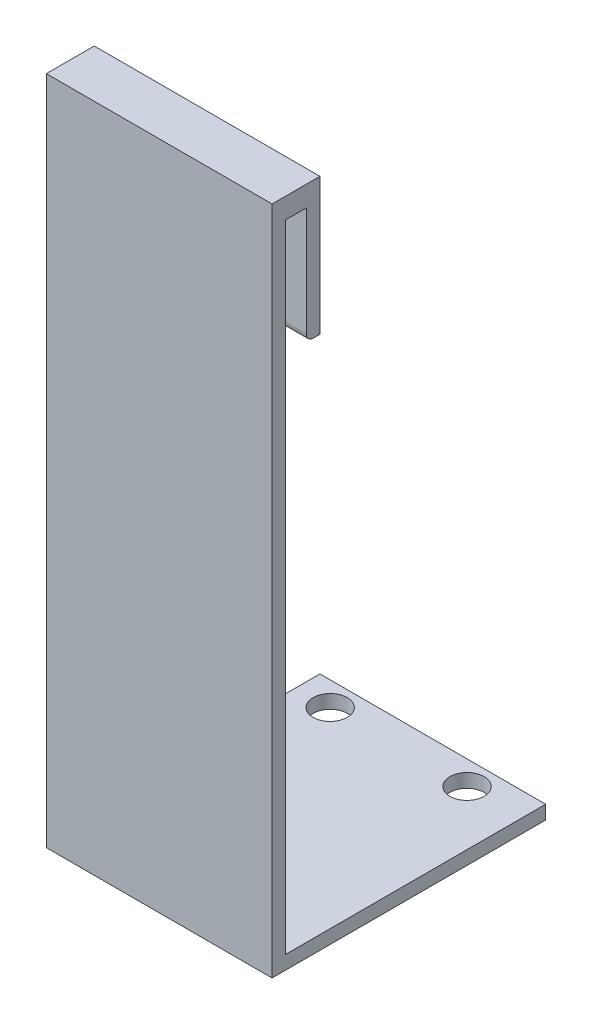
ISO-10303-21;
HEADER;
FILE_DESCRIPTION(('STEP AP214'),'2;1');
FILE_NAME('part.step','',(''),(''),'','','');
FILE_SCHEMA(('AUTOMOTIVE_DESIGN { 1 0 10303 214 1 1 1 1 }'));
ENDSEC;
DATA;
#1=APPLICATION_CONTEXT('core data for automotive mechanical design processes');
#2=APPLICATION_PROTOCOL_DEFINITION('international standard','automotive_design',2000,#1);
#3=PRODUCT_CONTEXT('',#1,'mechanical');
#4=PRODUCT('Part','Part','',(#3));
#5=PRODUCT_RELATED_PRODUCT_CATEGORY('part','',(#4));
#6=PRODUCT_DEFINITION_FORMATION('','',#4);
#7=PRODUCT_DEFINITION_CONTEXT('part definition',#1,'design');
#8=PRODUCT_DEFINITION('design','',#6,#7);
#9=PRODUCT_DEFINITION_SHAPE('','',#8);
#10=(LENGTH_UNIT() NAMED_UNIT(*) SI_UNIT(.MILLI.,.METRE.));
#11=(NAMED_UNIT(*) PLANE_ANGLE_UNIT() SI_UNIT($,.RADIAN.));
#12=(NAMED_UNIT(*) SI_UNIT($,.STERADIAN.) SOLID_ANGLE_UNIT());
#13=UNCERTAINTY_MEASURE_WITH_UNIT(LENGTH_MEASURE(1.E-05),#10,'distance_accuracy_value','');
#14=(GEOMETRIC_REPRESENTATION_CONTEXT(3) GLOBAL_UNCERTAINTY_ASSIGNED_CONTEXT((#13)) GLOBAL_UNIT_ASSIGNED_CONTEXT((#10,
#11,#12)) REPRESENTATION_CONTEXT('',''));
#15=CARTESIAN_POINT('',(0.,0.,0.));
#16=DIRECTION('',(0.,0.,1.));
#17=DIRECTION('',(1.,0.,0.));
#18=AXIS2_PLACEMENT_3D('',#15,#16,#17);
#19=CARTESIAN_POINT('',(-3.29775758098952,8.82480822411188,-0.840876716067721));
#20=DIRECTION('',(0.,0.,1.));
#21=DIRECTION('',(1.,0.,0.));
#22=AXIS2_PLACEMENT_3D('',#19,#20,#21);
#23=PLANE('',#22);
#24=DIRECTION('',(0.,-1.,0.));
#25=VECTOR('',#24,1.);
#26=CARTESIAN_POINT('',(-29.6977575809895,87.2248082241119,-0.840876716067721));
#27=LINE('',#26,#25);
#28=CARTESIAN_POINT('',(-29.6977575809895,84.8248082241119,-0.840876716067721));
#29=VERTEX_POINT('',#28);
#30=CARTESIAN_POINT('',(-29.6977575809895,10.4248082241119,-0.840876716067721));
#31=VERTEX_POINT('',#30);
#32=EDGE_CURVE('E224',#29,#31,#27,.T.);
#33=ORIENTED_EDGE('',*,*,#32,.F.);
#34=DIRECTION('',(1.,0.,0.));
#35=VECTOR('',#34,1.);
#36=CARTESIAN_POINT('',(-29.6977575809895,84.8248082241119,-0.840876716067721));
#37=LINE('',#36,#35);
#38=CARTESIAN_POINT('',(-3.29775758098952,84.8248082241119,-0.840876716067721));
#39=VERTEX_POINT('',#38);
#40=EDGE_CURVE('E144',#29,#39,#37,.T.);
#41=ORIENTED_EDGE('',*,*,#40,.T.);
#42=DIRECTION('',(0.,1.,0.));
#43=VECTOR('',#42,1.);
#44=CARTESIAN_POINT('',(-3.29775758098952,8.82480822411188,-0.840876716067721));
#45=LINE('',#44,#43);
#46=CARTESIAN_POINT('',(-3.29775758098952,10.4248082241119,-0.840876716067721));
#47=VERTEX_POINT('',#46);
#48=EDGE_CURVE('E212',#47,#39,#45,.T.);
#49=ORIENTED_EDGE('',*,*,#48,.F.);
#50=DIRECTION('',(1.,0.,0.));
#51=VECTOR('',#50,1.);
#52=CARTESIAN_POINT('',(-29.6977575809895,10.4248082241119,-0.840876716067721));
#53=LINE('',#52,#51);
#54=EDGE_CURVE('E208',#31,#47,#53,.T.);
#55=ORIENTED_EDGE('',*,*,#54,.F.);
#56=EDGE_LOOP('',(#33,#41,#49,#55));
#57=FACE_BOUND('',#56,.T.);
#58=ADVANCED_FACE('F50',(#57),#23,.F.);
#59=CARTESIAN_POINT('',(-29.6977575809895,8.82480822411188,0.759123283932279));
#60=DIRECTION('',(0.,1.,0.));
#61=DIRECTION('',(0.,0.,1.));
#62=AXIS2_PLACEMENT_3D('',#59,#60,#61);
#63=PLANE('',#62);
#64=CARTESIAN_POINT('',(-25.6977575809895,8.82480822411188,-28.4408767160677));
#65=DIRECTION('',(0.,1.,0.));
#66=DIRECTION('',(0.,0.,1.));
#67=AXIS2_PLACEMENT_3D('',#64,#65,#66);
#68=CIRCLE('',#67,2.);
#69=CARTESIAN_POINT('',(-25.6977575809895,8.82480822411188,-26.4408767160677));
#70=VERTEX_POINT('',#69);
#71=EDGE_CURVE('E166',#70,#70,#68,.T.);
#72=ORIENTED_EDGE('',*,*,#71,.T.);
#73=EDGE_LOOP('',(#72));
#74=FACE_BOUND('',#73,.T.);
#75=CARTESIAN_POINT('',(-9.69775758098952,8.82480822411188,-28.4408767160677));
#76=DIRECTION('',(0.,1.,0.));
#77=DIRECTION('',(0.,0.,1.));
#78=AXIS2_PLACEMENT_3D('',#75,#76,#77);
#79=CIRCLE('',#78,2.);
#80=CARTESIAN_POINT('',(-9.69775758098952,8.82480822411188,-26.4408767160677));
#81=VERTEX_POINT('',#80);
#82=EDGE_CURVE('E324',#81,#81,#79,.T.);
#83=ORIENTED_EDGE('',*,*,#82,.T.);
#84=EDGE_LOOP('',(#83));
#85=FACE_BOUND('',#84,.T.);
#86=DIRECTION('',(0.,0.,-1.));
#87=VECTOR('',#86,1.);
#88=CARTESIAN_POINT('',(-29.6977575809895,8.82480822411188,0.759123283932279));
#89=LINE('',#88,#87);
#90=CARTESIAN_POINT('',(-29.6977575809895,8.82480822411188,0.759123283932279));
#91=VERTEX_POINT('',#90);
#92=CARTESIAN_POINT('',(-29.6977575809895,8.82480822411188,-31.2408767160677));
#93=VERTEX_POINT('',#92);
#94=EDGE_CURVE('E233',#91,#93,#89,.T.);
#95=ORIENTED_EDGE('',*,*,#94,.T.);
#96=DIRECTION('',(1.,0.,0.));
#97=VECTOR('',#96,1.);
#98=CARTESIAN_POINT('',(-29.6977575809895,8.82480822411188,-31.2408767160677));
#99=LINE('',#98,#97);
#100=CARTESIAN_POINT('',(-3.29775758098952,8.82480822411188,-31.2408767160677));
#101=VERTEX_POINT('',#100);
#102=EDGE_CURVE('E201',#93,#101,#99,.T.);
#103=ORIENTED_EDGE('',*,*,#102,.T.);
#104=DIRECTION('',(0.,0.,-1.));
#105=VECTOR('',#104,1.);
#106=CARTESIAN_POINT('',(-3.29775758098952,8.82480822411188,0.759123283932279));
#107=LINE('',#106,#105);
#108=CARTESIAN_POINT('',(-3.29775758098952,8.82480822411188,0.759123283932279));
#109=VERTEX_POINT('',#108);
#110=EDGE_CURVE('E247',#109,#101,#107,.T.);
#111=ORIENTED_EDGE('',*,*,#110,.F.);
#112=DIRECTION('',(1.,0.,0.));
#113=VECTOR('',#112,1.);
#114=CARTESIAN_POINT('',(-29.6977575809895,8.82480822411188,0.759123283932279));
#115=LINE('',#114,#113);
#116=EDGE_CURVE('E219',#91,#109,#115,.T.);
#117=ORIENTED_EDGE('',*,*,#116,.F.);
#118=EDGE_LOOP('',(#95,#103,#111,#117));
#119=FACE_BOUND('',#118,.T.);
#120=ADVANCED_FACE('F364',(#74,#85,#119),#63,.F.);
#121=CARTESIAN_POINT('',(-3.29775758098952,8.82480822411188,0.759123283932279));
#122=DIRECTION('',(-1.,0.,0.));
#123=DIRECTION('',(0.,0.,1.));
#124=AXIS2_PLACEMENT_3D('',#121,#122,#123);
#125=PLANE('',#124);
#126=DIRECTION('',(0.,-1.,0.));
#127=VECTOR('',#126,1.);
#128=CARTESIAN_POINT('',(-3.29775758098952,71.2248082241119,-3.24087671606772));
#129=LINE('',#128,#127);
#130=CARTESIAN_POINT('',(-3.29775758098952,84.8248082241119,-3.24087671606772));
#131=VERTEX_POINT('',#130);
#132=CARTESIAN_POINT('',(-3.29775758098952,72.0248082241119,-3.24087671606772));
#133=VERTEX_POINT('',#132);
#134=EDGE_CURVE('E138',#131,#133,#129,.T.);
#135=ORIENTED_EDGE('',*,*,#134,.T.);
#136=CARTESIAN_POINT('',(-3.29775758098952,72.0248082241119,-4.04087671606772));
#137=DIRECTION('',(-1.,0.,0.));
#138=DIRECTION('',(0.,0.,1.));
#139=AXIS2_PLACEMENT_3D('',#136,#137,#138);
#140=CIRCLE('',#139,0.8);
#141=CARTESIAN_POINT('',(-3.29775758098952,71.2248082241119,-4.04087671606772));
#142=VERTEX_POINT('',#141);
#143=EDGE_CURVE('E73',#133,#142,#140,.F.);
#144=ORIENTED_EDGE('',*,*,#143,.T.);
#145=DIRECTION('',(0.,0.,-1.));
#146=VECTOR('',#145,1.);
#147=CARTESIAN_POINT('',(-3.29775758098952,71.2248082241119,-4.84087671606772));
#148=LINE('',#147,#146);
#149=CARTESIAN_POINT('',(-3.29775758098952,71.2248082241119,-4.84087671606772));
#150=VERTEX_POINT('',#149);
#151=EDGE_CURVE('E163',#142,#150,#148,.T.);
#152=ORIENTED_EDGE('',*,*,#151,.T.);
#153=DIRECTION('',(0.,1.,0.));
#154=VECTOR('',#153,1.);
#155=CARTESIAN_POINT('',(-3.29775758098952,87.2248082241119,-4.84087671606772));
#156=LINE('',#155,#154);
#157=CARTESIAN_POINT('',(-3.29775758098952,87.2248082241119,-4.84087671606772));
#158=VERTEX_POINT('',#157);
#159=EDGE_CURVE('E158',#150,#158,#156,.T.);
#160=ORIENTED_EDGE('',*,*,#159,.T.);
#161=DIRECTION('',(0.,0.,-1.));
#162=VECTOR('',#161,1.);
#163=CARTESIAN_POINT('',(-3.29775758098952,87.2248082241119,0.759123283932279));
#164=LINE('',#163,#162);
#165=CARTESIAN_POINT('',(-3.29775758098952,87.2248082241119,0.759123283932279));
#166=VERTEX_POINT('',#165);
#167=EDGE_CURVE('E244',#166,#158,#164,.T.);
#168=ORIENTED_EDGE('',*,*,#167,.F.);
#169=DIRECTION('',(0.,1.,0.));
#170=VECTOR('',#169,1.);
#171=CARTESIAN_POINT('',(-3.29775758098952,8.82480822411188,0.759123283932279));
#172=LINE('',#171,#170);
#173=EDGE_CURVE('E223',#109,#166,#172,.T.);
#174=ORIENTED_EDGE('',*,*,#173,.F.);
#175=ORIENTED_EDGE('',*,*,#110,.T.);
#176=DIRECTION('',(0.,1.,0.));
#177=VECTOR('',#176,1.);
#178=CARTESIAN_POINT('',(-3.29775758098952,10.4248082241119,-31.2408767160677));
#179=LINE('',#178,#177);
#180=CARTESIAN_POINT('',(-3.29775758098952,10.4248082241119,-31.2408767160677));
#181=VERTEX_POINT('',#180);
#182=EDGE_CURVE('E186',#101,#181,#179,.T.);
#183=ORIENTED_EDGE('',*,*,#182,.T.);
#184=DIRECTION('',(0.,0.,1.));
#185=VECTOR('',#184,1.);
#186=CARTESIAN_POINT('',(-3.29775758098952,10.4248082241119,-31.2408767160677));
#187=LINE('',#186,#185);
#188=EDGE_CURVE('E197',#181,#47,#187,.T.);
#189=ORIENTED_EDGE('',*,*,#188,.T.);
#190=ORIENTED_EDGE('',*,*,#48,.T.);
#191=DIRECTION('',(0.,0.,-1.));
#192=VECTOR('',#191,1.);
#193=CARTESIAN_POINT('',(-3.29775758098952,84.8248082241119,-3.24087671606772));
#194=LINE('',#193,#192);
#195=EDGE_CURVE('E175',#39,#131,#194,.T.);
#196=ORIENTED_EDGE('',*,*,#195,.T.);
#197=EDGE_LOOP('',(#135,#144,#152,#160,#168,#174,#175,#183,#189,#190,#196));
#198=FACE_BOUND('',#197,.T.);
#199=ADVANCED_FACE('F354',(#198),#125,.F.);
#200=CARTESIAN_POINT('',(-3.29775758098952,87.2248082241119,0.759123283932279));
#201=DIRECTION('',(0.,-1.,0.));
#202=DIRECTION('',(0.,0.,-1.));
#203=AXIS2_PLACEMENT_3D('',#200,#201,#202);
#204=PLANE('',#203);
#205=ORIENTED_EDGE('',*,*,#167,.T.);
#206=DIRECTION('',(1.,0.,0.));
#207=VECTOR('',#206,1.);
#208=CARTESIAN_POINT('',(-29.6977575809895,87.2248082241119,-4.84087671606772));
#209=LINE('',#208,#207);
#210=CARTESIAN_POINT('',(-29.6977575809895,87.2248082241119,-4.84087671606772));
#211=VERTEX_POINT('',#210);
#212=EDGE_CURVE('E182',#211,#158,#209,.T.);
#213=ORIENTED_EDGE('',*,*,#212,.F.);
#214=DIRECTION('',(0.,0.,-1.));
#215=VECTOR('',#214,1.);
#216=CARTESIAN_POINT('',(-29.6977575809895,87.2248082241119,0.759123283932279));
#217=LINE('',#216,#215);
#218=CARTESIAN_POINT('',(-29.6977575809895,87.2248082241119,0.759123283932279));
#219=VERTEX_POINT('',#218);
#220=EDGE_CURVE('E241',#219,#211,#217,.T.);
#221=ORIENTED_EDGE('',*,*,#220,.F.);
#222=DIRECTION('',(-1.,0.,0.));
#223=VECTOR('',#222,1.);
#224=CARTESIAN_POINT('',(-3.29775758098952,87.2248082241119,0.759123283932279));
#225=LINE('',#224,#223);
#226=EDGE_CURVE('E227',#166,#219,#225,.T.);
#227=ORIENTED_EDGE('',*,*,#226,.F.);
#228=EDGE_LOOP('',(#205,#213,#221,#227));
#229=FACE_BOUND('',#228,.T.);
#230=ADVANCED_FACE('F375',(#229),#204,.F.);
#231=CARTESIAN_POINT('',(-29.6977575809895,87.2248082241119,0.759123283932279));
#232=DIRECTION('',(1.,0.,0.));
#233=DIRECTION('',(0.,1.,0.));
#234=AXIS2_PLACEMENT_3D('',#231,#232,#233);
#235=PLANE('',#234);
#236=DIRECTION('',(0.,0.,-1.));
#237=VECTOR('',#236,1.);
#238=CARTESIAN_POINT('',(-29.6977575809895,71.2248082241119,-4.84087671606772));
#239=LINE('',#238,#237);
#240=CARTESIAN_POINT('',(-29.6977575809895,71.2248082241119,-4.04087671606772));
#241=VERTEX_POINT('',#240);
#242=CARTESIAN_POINT('',(-29.6977575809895,71.2248082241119,-4.84087671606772));
#243=VERTEX_POINT('',#242);
#244=EDGE_CURVE('E152',#241,#243,#239,.T.);
#245=ORIENTED_EDGE('',*,*,#244,.F.);
#246=CARTESIAN_POINT('',(-29.6977575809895,72.0248082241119,-4.04087671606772));
#247=DIRECTION('',(1.,0.,0.));
#248=DIRECTION('',(0.,1.,0.));
#249=AXIS2_PLACEMENT_3D('',#246,#247,#248);
#250=CIRCLE('',#249,0.8);
#251=CARTESIAN_POINT('',(-29.6977575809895,72.0248082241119,-3.24087671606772));
#252=VERTEX_POINT('',#251);
#253=EDGE_CURVE('E12',#241,#252,#250,.F.);
#254=ORIENTED_EDGE('',*,*,#253,.T.);
#255=DIRECTION('',(0.,-1.,0.));
#256=VECTOR('',#255,1.);
#257=CARTESIAN_POINT('',(-29.6977575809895,71.2248082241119,-3.24087671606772));
#258=LINE('',#257,#256);
#259=CARTESIAN_POINT('',(-29.6977575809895,84.8248082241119,-3.24087671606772));
#260=VERTEX_POINT('',#259);
#261=EDGE_CURVE('E136',#260,#252,#258,.T.);
#262=ORIENTED_EDGE('',*,*,#261,.F.);
#263=DIRECTION('',(0.,0.,-1.));
#264=VECTOR('',#263,1.);
#265=CARTESIAN_POINT('',(-29.6977575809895,84.8248082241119,-3.24087671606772));
#266=LINE('',#265,#264);
#267=EDGE_CURVE('E148',#29,#260,#266,.T.);
#268=ORIENTED_EDGE('',*,*,#267,.F.);
#269=ORIENTED_EDGE('',*,*,#32,.T.);
#270=DIRECTION('',(0.,0.,1.));
#271=VECTOR('',#270,1.);
#272=CARTESIAN_POINT('',(-29.6977575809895,10.4248082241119,-31.2408767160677));
#273=LINE('',#272,#271);
#274=CARTESIAN_POINT('',(-29.6977575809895,10.4248082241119,-31.2408767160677));
#275=VERTEX_POINT('',#274);
#276=EDGE_CURVE('E196',#275,#31,#273,.T.);
#277=ORIENTED_EDGE('',*,*,#276,.F.);
#278=DIRECTION('',(0.,1.,0.));
#279=VECTOR('',#278,1.);
#280=CARTESIAN_POINT('',(-29.6977575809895,10.4248082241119,-31.2408767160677));
#281=LINE('',#280,#279);
#282=EDGE_CURVE('E192',#93,#275,#281,.T.);
#283=ORIENTED_EDGE('',*,*,#282,.F.);
#284=ORIENTED_EDGE('',*,*,#94,.F.);
#285=DIRECTION('',(0.,-1.,0.));
#286=VECTOR('',#285,1.);
#287=CARTESIAN_POINT('',(-29.6977575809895,87.2248082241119,0.759123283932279));
#288=LINE('',#287,#286);
#289=EDGE_CURVE('E230',#219,#91,#288,.T.);
#290=ORIENTED_EDGE('',*,*,#289,.F.);
#291=ORIENTED_EDGE('',*,*,#220,.T.);
#292=DIRECTION('',(0.,1.,0.));
#293=VECTOR('',#292,1.);
#294=CARTESIAN_POINT('',(-29.6977575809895,87.2248082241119,-4.84087671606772));
#295=LINE('',#294,#293);
#296=EDGE_CURVE('E171',#243,#211,#295,.T.);
#297=ORIENTED_EDGE('',*,*,#296,.F.);
#298=EDGE_LOOP('',(#245,#254,#262,#268,#269,#277,#283,#284,#290,#291,#297));
#299=FACE_BOUND('',#298,.T.);
#300=ADVANCED_FACE('F147',(#299),#235,.F.);
#301=CARTESIAN_POINT('',(-3.29775758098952,8.82480822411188,0.759123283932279));
#302=DIRECTION('',(0.,0.,1.));
#303=DIRECTION('',(1.,0.,0.));
#304=AXIS2_PLACEMENT_3D('',#301,#302,#303);
#305=PLANE('',#304);
#306=ORIENTED_EDGE('',*,*,#116,.T.);
#307=ORIENTED_EDGE('',*,*,#173,.T.);
#308=ORIENTED_EDGE('',*,*,#226,.T.);
#309=ORIENTED_EDGE('',*,*,#289,.T.);
#310=EDGE_LOOP('',(#306,#307,#308,#309));
#311=FACE_BOUND('',#310,.T.);
#312=ADVANCED_FACE('F349',(#311),#305,.T.);
#313=CARTESIAN_POINT('',(-29.6977575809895,10.4248082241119,-31.2408767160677));
#314=DIRECTION('',(0.,1.,0.));
#315=DIRECTION('',(0.,0.,1.));
#316=AXIS2_PLACEMENT_3D('',#313,#314,#315);
#317=PLANE('',#316);
#318=CARTESIAN_POINT('',(-25.6977575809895,10.4248082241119,-28.4408767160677));
#319=DIRECTION('',(0.,1.,0.));
#320=DIRECTION('',(0.,0.,1.));
#321=AXIS2_PLACEMENT_3D('',#318,#319,#320);
#322=CIRCLE('',#321,2.);
#323=CARTESIAN_POINT('',(-25.6977575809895,10.4248082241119,-26.4408767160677));
#324=VERTEX_POINT('',#323);
#325=EDGE_CURVE('E329',#324,#324,#322,.T.);
#326=ORIENTED_EDGE('',*,*,#325,.F.);
#327=EDGE_LOOP('',(#326));
#328=FACE_BOUND('',#327,.T.);
#329=CARTESIAN_POINT('',(-9.69775758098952,10.4248082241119,-28.4408767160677));
#330=DIRECTION('',(0.,1.,0.));
#331=DIRECTION('',(0.,0.,1.));
#332=AXIS2_PLACEMENT_3D('',#329,#330,#331);
#333=CIRCLE('',#332,2.);
#334=CARTESIAN_POINT('',(-9.69775758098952,10.4248082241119,-26.4408767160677));
#335=VERTEX_POINT('',#334);
#336=EDGE_CURVE('E334',#335,#335,#333,.T.);
#337=ORIENTED_EDGE('',*,*,#336,.F.);
#338=EDGE_LOOP('',(#337));
#339=FACE_BOUND('',#338,.T.);
#340=ORIENTED_EDGE('',*,*,#188,.F.);
#341=DIRECTION('',(1.,0.,0.));
#342=VECTOR('',#341,1.);
#343=CARTESIAN_POINT('',(-29.6977575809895,10.4248082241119,-31.2408767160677));
#344=LINE('',#343,#342);
#345=EDGE_CURVE('E213',#275,#181,#344,.T.);
#346=ORIENTED_EDGE('',*,*,#345,.F.);
#347=ORIENTED_EDGE('',*,*,#276,.T.);
#348=ORIENTED_EDGE('',*,*,#54,.T.);
#349=EDGE_LOOP('',(#340,#346,#347,#348));
#350=FACE_BOUND('',#349,.T.);
#351=ADVANCED_FACE('F345',(#328,#339,#350),#317,.T.);
#352=CARTESIAN_POINT('',(-29.6977575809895,10.4248082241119,-31.2408767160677));
#353=DIRECTION('',(0.,0.,-1.));
#354=DIRECTION('',(-1.,0.,0.));
#355=AXIS2_PLACEMENT_3D('',#352,#353,#354);
#356=PLANE('',#355);
#357=ORIENTED_EDGE('',*,*,#182,.F.);
#358=ORIENTED_EDGE('',*,*,#102,.F.);
#359=ORIENTED_EDGE('',*,*,#282,.T.);
#360=ORIENTED_EDGE('',*,*,#345,.T.);
#361=EDGE_LOOP('',(#357,#358,#359,#360));
#362=FACE_BOUND('',#361,.T.);
#363=ADVANCED_FACE('F348',(#362),#356,.T.);
#364=CARTESIAN_POINT('',(-29.6977575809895,87.2248082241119,-4.84087671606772));
#365=DIRECTION('',(0.,0.,-1.));
#366=DIRECTION('',(0.,1.,0.));
#367=AXIS2_PLACEMENT_3D('',#364,#365,#366);
#368=PLANE('',#367);
#369=ORIENTED_EDGE('',*,*,#159,.F.);
#370=DIRECTION('',(1.,0.,0.));
#371=VECTOR('',#370,1.);
#372=CARTESIAN_POINT('',(-29.6977575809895,71.2248082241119,-4.84087671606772));
#373=LINE('',#372,#371);
#374=EDGE_CURVE('E143',#243,#150,#373,.T.);
#375=ORIENTED_EDGE('',*,*,#374,.F.);
#376=ORIENTED_EDGE('',*,*,#296,.T.);
#377=ORIENTED_EDGE('',*,*,#212,.T.);
#378=EDGE_LOOP('',(#369,#375,#376,#377));
#379=FACE_BOUND('',#378,.T.);
#380=ADVANCED_FACE('F416',(#379),#368,.T.);
#381=CARTESIAN_POINT('',(-29.6977575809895,71.2248082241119,-4.84087671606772));
#382=DIRECTION('',(0.,-1.,0.));
#383=DIRECTION('',(0.,0.,-1.));
#384=AXIS2_PLACEMENT_3D('',#381,#382,#383);
#385=PLANE('',#384);
#386=ORIENTED_EDGE('',*,*,#151,.F.);
#387=DIRECTION('',(1.,0.,0.));
#388=VECTOR('',#387,1.);
#389=CARTESIAN_POINT('',(-29.6977575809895,71.2248082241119,-4.04087671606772));
#390=LINE('',#389,#388);
#391=EDGE_CURVE('E59',#142,#241,#390,.F.);
#392=ORIENTED_EDGE('',*,*,#391,.T.);
#393=ORIENTED_EDGE('',*,*,#244,.T.);
#394=ORIENTED_EDGE('',*,*,#374,.T.);
#395=EDGE_LOOP('',(#386,#392,#393,#394));
#396=FACE_BOUND('',#395,.T.);
#397=ADVANCED_FACE('F422',(#396),#385,.T.);
#398=CARTESIAN_POINT('',(-29.6977575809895,71.2248082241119,-3.24087671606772));
#399=DIRECTION('',(0.,0.,1.));
#400=DIRECTION('',(1.,0.,0.));
#401=AXIS2_PLACEMENT_3D('',#398,#399,#400);
#402=PLANE('',#401);
#403=ORIENTED_EDGE('',*,*,#261,.T.);
#404=DIRECTION('',(1.,0.,0.));
#405=VECTOR('',#404,1.);
#406=CARTESIAN_POINT('',(-29.6977575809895,72.0248082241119,-3.24087671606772));
#407=LINE('',#406,#405);
#408=EDGE_CURVE('E250',#252,#133,#407,.T.);
#409=ORIENTED_EDGE('',*,*,#408,.T.);
#410=ORIENTED_EDGE('',*,*,#134,.F.);
#411=DIRECTION('',(1.,0.,0.));
#412=VECTOR('',#411,1.);
#413=CARTESIAN_POINT('',(-29.6977575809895,84.8248082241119,-3.24087671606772));
#414=LINE('',#413,#412);
#415=EDGE_CURVE('E132',#260,#131,#414,.T.);
#416=ORIENTED_EDGE('',*,*,#415,.F.);
#417=EDGE_LOOP('',(#403,#409,#410,#416));
#418=FACE_BOUND('',#417,.T.);
#419=ADVANCED_FACE('F134',(#418),#402,.T.);
#420=CARTESIAN_POINT('',(-29.6977575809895,84.8248082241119,-3.24087671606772));
#421=DIRECTION('',(0.,-1.,0.));
#422=DIRECTION('',(0.,0.,-1.));
#423=AXIS2_PLACEMENT_3D('',#420,#421,#422);
#424=PLANE('',#423);
#425=ORIENTED_EDGE('',*,*,#195,.F.);
#426=ORIENTED_EDGE('',*,*,#40,.F.);
#427=ORIENTED_EDGE('',*,*,#267,.T.);
#428=ORIENTED_EDGE('',*,*,#415,.T.);
#429=EDGE_LOOP('',(#425,#426,#427,#428));
#430=FACE_BOUND('',#429,.T.);
#431=ADVANCED_FACE('F154',(#430),#424,.T.);
#432=CARTESIAN_POINT('',(-29.6977575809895,72.0248082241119,-4.04087671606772));
#433=DIRECTION('',(1.,0.,0.));
#434=DIRECTION('',(0.,0.,-1.));
#435=AXIS2_PLACEMENT_3D('',#432,#433,#434);
#436=CYLINDRICAL_SURFACE('',#435,0.8);
#437=ORIENTED_EDGE('',*,*,#253,.F.);
#438=ORIENTED_EDGE('',*,*,#391,.F.);
#439=ORIENTED_EDGE('',*,*,#143,.F.);
#440=ORIENTED_EDGE('',*,*,#408,.F.);
#441=EDGE_LOOP('',(#437,#438,#439,#440));
#442=FACE_BOUND('',#441,.T.);
#443=ADVANCED_FACE('F52',(#442),#436,.T.);
#444=CARTESIAN_POINT('',(-9.69775758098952,2.42480822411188,-28.4408767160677));
#445=DIRECTION('',(0.,1.,0.));
#446=DIRECTION('',(0.,0.,1.));
#447=AXIS2_PLACEMENT_3D('',#444,#445,#446);
#448=CYLINDRICAL_SURFACE('',#447,2.);
#449=ORIENTED_EDGE('',*,*,#336,.T.);
#450=EDGE_LOOP('',(#449));
#451=FACE_BOUND('',#450,.T.);
#452=ORIENTED_EDGE('',*,*,#82,.F.);
#453=EDGE_LOOP('',(#452));
#454=FACE_BOUND('',#453,.T.);
#455=ADVANCED_FACE('F342',(#451,#454),#448,.F.);
#456=CARTESIAN_POINT('',(-25.6977575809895,2.42480822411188,-28.4408767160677));
#457=DIRECTION('',(0.,1.,0.));
#458=DIRECTION('',(0.,0.,1.));
#459=AXIS2_PLACEMENT_3D('',#456,#457,#458);
#460=CYLINDRICAL_SURFACE('',#459,2.);
#461=ORIENTED_EDGE('',*,*,#325,.T.);
#462=EDGE_LOOP('',(#461));
#463=FACE_BOUND('',#462,.T.);
#464=ORIENTED_EDGE('',*,*,#71,.F.);
#465=EDGE_LOOP('',(#464));
#466=FACE_BOUND('',#465,.T.);
#467=ADVANCED_FACE('F459',(#463,#466),#460,.F.);
#468=CLOSED_SHELL('',(#58,#120,#199,#230,#300,#312,#351,#363,#380,#397,#419,#431,#443,#455,#467));
#469=MANIFOLD_SOLID_BREP('B2',#468);
#470=ADVANCED_BREP_SHAPE_REPRESENTATION('',(#18,#469),#14);
#471=SHAPE_DEFINITION_REPRESENTATION(#9,#470);
ENDSEC;
END-ISO-10303-21;
